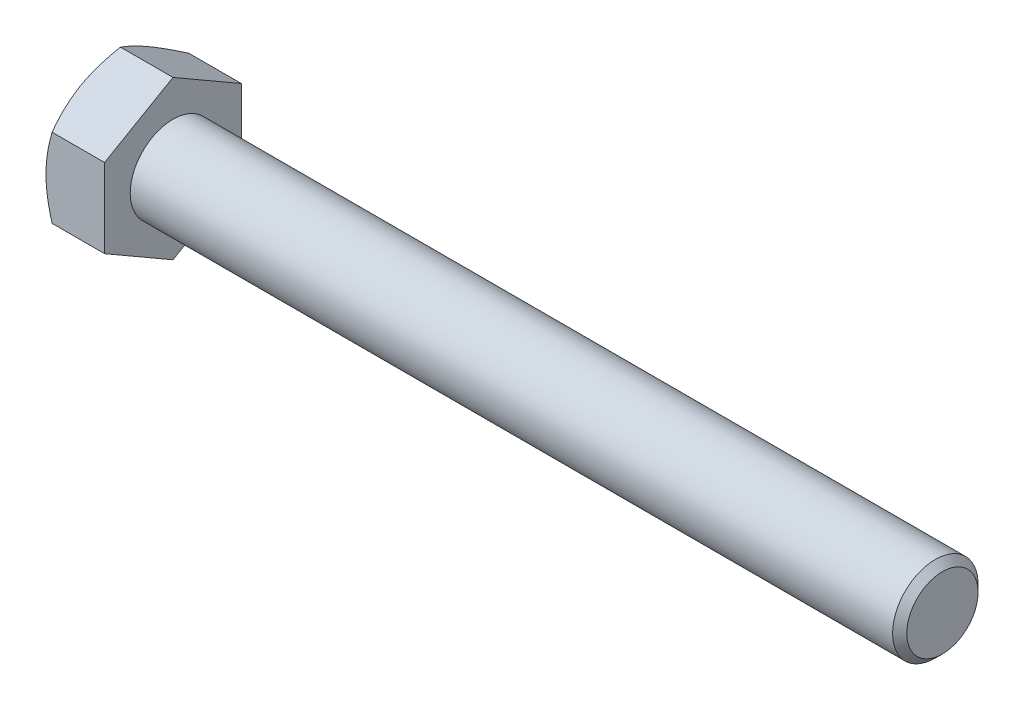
ISO-10303-21;
HEADER;
FILE_DESCRIPTION(('STEP AP214'),'2;1');
FILE_NAME('part.step','',(''),(''),'','','');
FILE_SCHEMA(('AUTOMOTIVE_DESIGN { 1 0 10303 214 1 1 1 1 }'));
ENDSEC;
DATA;
#1=APPLICATION_CONTEXT('core data for automotive mechanical design processes');
#2=APPLICATION_PROTOCOL_DEFINITION('international standard','automotive_design',2000,#1);
#3=PRODUCT_CONTEXT('',#1,'mechanical');
#4=PRODUCT('Part','Part','',(#3));
#5=PRODUCT_RELATED_PRODUCT_CATEGORY('part','',(#4));
#6=PRODUCT_DEFINITION_FORMATION('','',#4);
#7=PRODUCT_DEFINITION_CONTEXT('part definition',#1,'design');
#8=PRODUCT_DEFINITION('design','',#6,#7);
#9=PRODUCT_DEFINITION_SHAPE('','',#8);
#10=(LENGTH_UNIT() NAMED_UNIT(*) SI_UNIT(.MILLI.,.METRE.));
#11=(NAMED_UNIT(*) PLANE_ANGLE_UNIT() SI_UNIT($,.RADIAN.));
#12=(NAMED_UNIT(*) SI_UNIT($,.STERADIAN.) SOLID_ANGLE_UNIT());
#13=UNCERTAINTY_MEASURE_WITH_UNIT(LENGTH_MEASURE(1.E-05),#10,'distance_accuracy_value','');
#14=(GEOMETRIC_REPRESENTATION_CONTEXT(3) GLOBAL_UNCERTAINTY_ASSIGNED_CONTEXT((#13)) GLOBAL_UNIT_ASSIGNED_CONTEXT((#10,
#11,#12)) REPRESENTATION_CONTEXT('',''));
#15=CARTESIAN_POINT('',(0.,0.,0.));
#16=DIRECTION('',(0.,0.,1.));
#17=DIRECTION('',(1.,0.,0.));
#18=AXIS2_PLACEMENT_3D('',#15,#16,#17);
#19=CARTESIAN_POINT('',(6.85,4.618802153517,-8.));
#20=DIRECTION('',(0.,-0.866025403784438,0.500000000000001));
#21=DIRECTION('',(0.,-0.500000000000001,-0.866025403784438));
#22=AXIS2_PLACEMENT_3D('',#19,#20,#21);
#23=PLANE('',#22);
#24=CARTESIAN_POINT('',(0.714597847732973,9.23771977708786,0.0002));
#25=CARTESIAN_POINT('',(0.655990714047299,9.13619343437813,-0.175648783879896));
#26=CARTESIAN_POINT('',(0.600043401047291,9.03428856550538,-0.352153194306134));
#27=CARTESIAN_POINT('',(0.494201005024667,8.82965122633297,-0.706595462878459));
#28=CARTESIAN_POINT('',(0.444308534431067,8.72691841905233,-0.884533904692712));
#29=CARTESIAN_POINT('',(0.304692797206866,8.41707512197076,-1.42119823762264));
#30=CARTESIAN_POINT('',(0.22528117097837,8.20874154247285,-1.78204258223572));
#31=CARTESIAN_POINT('',(0.13216164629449,7.89697436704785,-2.32203917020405));
#32=CARTESIAN_POINT('',(0.105634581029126,7.79447216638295,-2.49957818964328));
#33=CARTESIAN_POINT('',(0.0611531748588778,7.58900421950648,-2.8554591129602));
#34=CARTESIAN_POINT('',(0.0431980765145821,7.4860385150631,-3.03380094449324));
#35=CARTESIAN_POINT('',(0.0163156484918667,7.27992981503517,-3.39079168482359));
#36=CARTESIAN_POINT('',(0.00737807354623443,7.17678715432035,-3.5694400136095));
#37=CARTESIAN_POINT('',(-0.00127769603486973,6.97040655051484,-3.92690170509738));
#38=CARTESIAN_POINT('',(-0.000996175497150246,6.86716861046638,-4.10571506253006));
#39=CARTESIAN_POINT('',(0.0081450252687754,6.67416139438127,-4.4400133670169));
#40=CARTESIAN_POINT('',(0.0158896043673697,6.58437849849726,-4.59552190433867));
#41=CARTESIAN_POINT('',(0.0382011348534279,6.40502298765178,-4.90617476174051));
#42=CARTESIAN_POINT('',(0.0527685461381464,6.31545038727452,-5.06131905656));
#43=CARTESIAN_POINT('',(0.106360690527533,6.04707935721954,-5.52615131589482));
#44=CARTESIAN_POINT('',(0.155268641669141,5.86875596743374,-5.83501648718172));
#45=CARTESIAN_POINT('',(0.277539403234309,5.51021755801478,-6.4560232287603));
#46=CARTESIAN_POINT('',(0.351420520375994,5.3300482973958,-6.76808554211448));
#47=CARTESIAN_POINT('',(0.519100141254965,4.97239658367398,-7.38755648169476));
#48=CARTESIAN_POINT('',(0.612859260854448,4.79490955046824,-7.69497304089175));
#49=CARTESIAN_POINT('',(0.714597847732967,4.61868668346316,-8.0002));
#50=B_SPLINE_CURVE_WITH_KNOTS('',3,(#24,#25,#26,#27,#28,#29,#30,#31,#32,#33,#34,#35,#36,#37,#38,
#39,#40,#41,#42,#43,#44,#45,#46,#47,#48,#49),.UNSPECIFIED.,.F.,.F.,(4,2,2,2,2,2,2,2,2,2,2,2,4),
(0.,0.63397354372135,1.26821965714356,2.53934712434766,3.15934343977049,3.77928496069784,
4.39852133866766,5.01773858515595,5.55680239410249,6.09590254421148,7.17487077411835,
8.27776850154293,9.37850115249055),.UNSPECIFIED.);
#51=CARTESIAN_POINT('',(0.714531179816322,9.23760430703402,0.));
#52=VERTEX_POINT('',#51);
#53=CARTESIAN_POINT('',(0.,6.92820323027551,-4.00000000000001));
#54=VERTEX_POINT('',#53);
#55=EDGE_CURVE('E52',#52,#54,#50,.T.);
#56=ORIENTED_EDGE('',*,*,#55,.F.);
#57=DIRECTION('',(-1.,0.,0.));
#58=VECTOR('',#57,1.);
#59=CARTESIAN_POINT('',(6.85,9.23760430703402,0.));
#60=LINE('',#59,#58);
#61=CARTESIAN_POINT('',(6.85,9.23760430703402,0.));
#62=VERTEX_POINT('',#61);
#63=EDGE_CURVE('E148',#62,#52,#60,.T.);
#64=ORIENTED_EDGE('',*,*,#63,.F.);
#65=DIRECTION('',(0.,0.500000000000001,0.866025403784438));
#66=VECTOR('',#65,1.);
#67=CARTESIAN_POINT('',(6.85,4.618802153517,-8.));
#68=LINE('',#67,#66);
#69=CARTESIAN_POINT('',(6.85,4.618802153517,-8.));
#70=VERTEX_POINT('',#69);
#71=EDGE_CURVE('E233',#70,#62,#68,.T.);
#72=ORIENTED_EDGE('',*,*,#71,.F.);
#73=DIRECTION('',(-1.,0.,0.));
#74=VECTOR('',#73,1.);
#75=CARTESIAN_POINT('',(6.85,4.618802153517,-8.));
#76=LINE('',#75,#74);
#77=CARTESIAN_POINT('',(0.714531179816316,4.618802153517,-8.));
#78=VERTEX_POINT('',#77);
#79=EDGE_CURVE('E136',#70,#78,#76,.T.);
#80=ORIENTED_EDGE('',*,*,#79,.T.);
#81=EDGE_CURVE('E130',#54,#78,#50,.T.);
#82=ORIENTED_EDGE('',*,*,#81,.F.);
#83=EDGE_LOOP('',(#56,#64,#72,#80,#82));
#84=FACE_BOUND('',#83,.T.);
#85=ADVANCED_FACE('F36',(#84),#23,.F.);
#86=CARTESIAN_POINT('',(6.85,9.23760430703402,0.));
#87=DIRECTION('',(0.,-0.866025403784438,-0.500000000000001));
#88=DIRECTION('',(0.,0.500000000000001,-0.866025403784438));
#89=AXIS2_PLACEMENT_3D('',#86,#87,#88);
#90=PLANE('',#89);
#91=CARTESIAN_POINT('',(0.714597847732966,4.61868668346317,8.0002));
#92=CARTESIAN_POINT('',(0.655990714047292,4.72021302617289,7.8243512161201));
#93=CARTESIAN_POINT('',(0.600043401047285,4.82211789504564,7.64784680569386));
#94=CARTESIAN_POINT('',(0.494201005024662,5.02675523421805,7.29340453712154));
#95=CARTESIAN_POINT('',(0.444308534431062,5.12948804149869,7.11546609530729));
#96=CARTESIAN_POINT('',(0.304692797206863,5.43933133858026,6.57880176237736));
#97=CARTESIAN_POINT('',(0.225281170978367,5.64766491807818,6.21795741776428));
#98=CARTESIAN_POINT('',(0.132161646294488,5.95943209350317,5.67796082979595));
#99=CARTESIAN_POINT('',(0.105634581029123,6.06193429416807,5.50042181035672));
#100=CARTESIAN_POINT('',(0.0611531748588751,6.26740224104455,5.1445408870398));
#101=CARTESIAN_POINT('',(0.04319807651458,6.37036794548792,4.96619905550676));
#102=CARTESIAN_POINT('',(0.0163156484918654,6.57647664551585,4.60920831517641));
#103=CARTESIAN_POINT('',(0.00737807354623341,6.67961930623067,4.4305599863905));
#104=CARTESIAN_POINT('',(-0.00127769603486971,6.88599991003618,4.07309829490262));
#105=CARTESIAN_POINT('',(-0.000996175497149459,6.98923785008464,3.89428493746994));
#106=CARTESIAN_POINT('',(0.00814502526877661,7.18224506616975,3.5599866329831));
#107=CARTESIAN_POINT('',(0.0158896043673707,7.27202796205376,3.40447809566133));
#108=CARTESIAN_POINT('',(0.0382011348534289,7.45138347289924,3.09382523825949));
#109=CARTESIAN_POINT('',(0.0527685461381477,7.54095607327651,2.93868094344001));
#110=CARTESIAN_POINT('',(0.106360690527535,7.80932710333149,2.47384868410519));
#111=CARTESIAN_POINT('',(0.155268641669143,7.98765049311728,2.16498351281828));
#112=CARTESIAN_POINT('',(0.277539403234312,8.34618890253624,1.5439767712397));
#113=CARTESIAN_POINT('',(0.351420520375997,8.52635816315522,1.23191445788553));
#114=CARTESIAN_POINT('',(0.519100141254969,8.88400987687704,0.612443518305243));
#115=CARTESIAN_POINT('',(0.612859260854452,9.06149691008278,0.30502695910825));
#116=CARTESIAN_POINT('',(0.714597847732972,9.23771977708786,-0.00019999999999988));
#117=B_SPLINE_CURVE_WITH_KNOTS('',3,(#91,#92,#93,#94,#95,#96,#97,#98,#99,#100,#101,#102,#103,
#104,#105,#106,#107,#108,#109,#110,#111,#112,#113,#114,#115,#116),.UNSPECIFIED.,.F.,.F.,(4,2,2,
2,2,2,2,2,2,2,2,2,4),(0.,0.633973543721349,1.26821965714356,2.53934712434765,3.15934343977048,
3.77928496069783,4.39852133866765,5.01773858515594,5.55680239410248,6.09590254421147,
7.17487077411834,8.27776850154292,9.37850115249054),.UNSPECIFIED.);
#118=CARTESIAN_POINT('',(0.714531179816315,4.61880215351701,8.));
#119=VERTEX_POINT('',#118);
#120=CARTESIAN_POINT('',(0.,6.92820323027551,4.00000000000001));
#121=VERTEX_POINT('',#120);
#122=EDGE_CURVE('E59',#119,#121,#117,.T.);
#123=ORIENTED_EDGE('',*,*,#122,.F.);
#124=DIRECTION('',(-1.,0.,0.));
#125=VECTOR('',#124,1.);
#126=CARTESIAN_POINT('',(6.85,4.61880215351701,8.));
#127=LINE('',#126,#125);
#128=CARTESIAN_POINT('',(6.85,4.61880215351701,8.));
#129=VERTEX_POINT('',#128);
#130=EDGE_CURVE('E146',#129,#119,#127,.T.);
#131=ORIENTED_EDGE('',*,*,#130,.F.);
#132=DIRECTION('',(0.,-0.500000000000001,0.866025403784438));
#133=VECTOR('',#132,1.);
#134=CARTESIAN_POINT('',(6.85,9.23760430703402,0.));
#135=LINE('',#134,#133);
#136=EDGE_CURVE('E231',#62,#129,#135,.T.);
#137=ORIENTED_EDGE('',*,*,#136,.F.);
#138=ORIENTED_EDGE('',*,*,#63,.T.);
#139=EDGE_CURVE('E163',#121,#52,#117,.T.);
#140=ORIENTED_EDGE('',*,*,#139,.F.);
#141=EDGE_LOOP('',(#123,#131,#137,#138,#140));
#142=FACE_BOUND('',#141,.T.);
#143=ADVANCED_FACE('F169',(#142),#90,.F.);
#144=CARTESIAN_POINT('',(6.85,4.61880215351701,8.));
#145=DIRECTION('',(0.,0.,-1.));
#146=DIRECTION('',(0.,1.,0.));
#147=AXIS2_PLACEMENT_3D('',#144,#145,#146);
#148=PLANE('',#147);
#149=CARTESIAN_POINT('',(4.02490591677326,-12.6546855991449,8.));
#150=CARTESIAN_POINT('',(3.85338488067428,-12.3031246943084,8.));
#151=CARTESIAN_POINT('',(3.68343820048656,-11.9507829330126,8.));
#152=CARTESIAN_POINT('',(3.3475742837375,-11.2441233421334,8.));
#153=CARTESIAN_POINT('',(3.18165763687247,-10.8898052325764,8.));
#154=CARTESIAN_POINT('',(2.85395194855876,-10.1770689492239,8.));
#155=CARTESIAN_POINT('',(2.69218825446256,-9.81863908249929,8.));
#156=CARTESIAN_POINT('',(2.37495727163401,-9.09901413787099,8.));
#157=CARTESIAN_POINT('',(2.21948970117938,-8.73781918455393,8.));
#158=CARTESIAN_POINT('',(1.91124909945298,-7.9995005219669,8.));
#159=CARTESIAN_POINT('',(1.75875676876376,-7.6222589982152,8.));
#160=CARTESIAN_POINT('',(1.46472411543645,-6.86345577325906,8.));
#161=CARTESIAN_POINT('',(1.323184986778,-6.48189360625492,8.));
#162=CARTESIAN_POINT('',(1.05459432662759,-5.71447512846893,8.));
#163=CARTESIAN_POINT('',(0.927515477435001,-5.32862847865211,8.));
#164=CARTESIAN_POINT('',(0.69175721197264,-4.55141880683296,8.));
#165=CARTESIAN_POINT('',(0.583072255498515,-4.16005748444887,8.));
#166=CARTESIAN_POINT('',(0.389750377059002,-3.37376378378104,8.));
#167=CARTESIAN_POINT('',(0.304973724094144,-2.97886668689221,8.));
#168=CARTESIAN_POINT('',(0.199275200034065,-2.38273452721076,8.));
#169=CARTESIAN_POINT('',(0.167618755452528,-2.18337977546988,8.));
#170=CARTESIAN_POINT('',(0.112075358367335,-1.78359737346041,8.));
#171=CARTESIAN_POINT('',(0.0881876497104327,-1.58316982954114,8.));
#172=CARTESIAN_POINT('',(0.0489706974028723,-1.184235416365,8.));
#173=CARTESIAN_POINT('',(0.0335291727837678,-0.985739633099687,8.));
#174=CARTESIAN_POINT('',(0.0110629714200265,-0.58827208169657,8.));
#175=CARTESIAN_POINT('',(0.00403814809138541,-0.38930032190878,8.));
#176=CARTESIAN_POINT('',(-0.00142584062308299,0.00876221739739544,8.));
#177=CARTESIAN_POINT('',(0.000134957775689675,0.207852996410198,8.));
#178=CARTESIAN_POINT('',(0.0118014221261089,0.605786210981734,8.));
#179=CARTESIAN_POINT('',(0.0219074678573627,0.804628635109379,8.));
#180=CARTESIAN_POINT('',(0.0557165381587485,1.27520492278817,8.));
#181=CARTESIAN_POINT('',(0.0830672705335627,1.5466829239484,8.));
#182=CARTESIAN_POINT('',(0.152259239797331,2.08777093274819,8.));
#183=CARTESIAN_POINT('',(0.194102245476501,2.35738070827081,8.));
#184=CARTESIAN_POINT('',(0.33916319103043,3.1630177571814,7.99999999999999));
#185=CARTESIAN_POINT('',(0.461891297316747,3.69558689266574,8.));
#186=CARTESIAN_POINT('',(0.676586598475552,4.49226054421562,8.));
#187=CARTESIAN_POINT('',(0.754301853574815,4.76044513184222,8.));
#188=CARTESIAN_POINT('',(0.918275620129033,5.29421545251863,8.));
#189=CARTESIAN_POINT('',(1.00453419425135,5.55980116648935,8.));
#190=CARTESIAN_POINT('',(1.1841720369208,6.08844838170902,8.));
#191=CARTESIAN_POINT('',(1.27754932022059,6.35151056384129,8.));
#192=CARTESIAN_POINT('',(1.47027925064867,6.8754242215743,8.));
#193=CARTESIAN_POINT('',(1.56963178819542,7.1362757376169,7.99999999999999));
#194=CARTESIAN_POINT('',(1.83061788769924,7.80218876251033,7.99999999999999));
#195=CARTESIAN_POINT('',(1.99585031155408,8.20583801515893,7.99999999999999));
#196=CARTESIAN_POINT('',(2.33560644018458,9.00922091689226,7.99999999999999));
#197=CARTESIAN_POINT('',(2.51013099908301,9.40895420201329,7.99999999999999));
#198=CARTESIAN_POINT('',(2.86641485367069,10.2053302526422,7.99999999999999));
#199=CARTESIAN_POINT('',(3.04817649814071,10.6019719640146,7.99999999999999));
#200=CARTESIAN_POINT('',(3.41731475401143,11.3926098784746,7.99999999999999));
#201=CARTESIAN_POINT('',(3.60469118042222,11.7866061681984,7.99999999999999));
#202=CARTESIAN_POINT('',(3.98417977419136,12.5730081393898,7.99999999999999));
#203=CARTESIAN_POINT('',(4.17629838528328,12.9654107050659,7.99999999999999));
#204=CARTESIAN_POINT('',(4.56413461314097,13.7484335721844,7.99999999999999));
#205=CARTESIAN_POINT('',(4.75985225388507,14.1390538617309,7.99999999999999));
#206=CARTESIAN_POINT('',(5.15417791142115,14.9187387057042,7.99999999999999));
#207=CARTESIAN_POINT('',(5.35278537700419,15.3078035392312,7.99999999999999));
#208=CARTESIAN_POINT('',(5.75241278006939,16.0846929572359,7.99999999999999));
#209=CARTESIAN_POINT('',(5.95343272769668,16.4725175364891,7.99999999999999));
#210=CARTESIAN_POINT('',(6.52023158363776,17.559169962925,7.99999999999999));
#211=CARTESIAN_POINT('',(6.88826669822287,18.2568208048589,7.99999999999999));
#212=CARTESIAN_POINT('',(7.62911646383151,19.6496204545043,7.99999999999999));
#213=CARTESIAN_POINT('',(8.00193136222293,20.3447691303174,7.99999999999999));
#214=CARTESIAN_POINT('',(8.74998840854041,21.7309493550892,7.99999999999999));
#215=CARTESIAN_POINT('',(9.12521930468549,22.4219869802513,7.99999999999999));
#216=CARTESIAN_POINT('',(9.69012626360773,23.4573861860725,7.99999999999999));
#217=CARTESIAN_POINT('',(9.87876537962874,23.8023143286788,7.99999999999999));
#218=CARTESIAN_POINT('',(10.2566598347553,24.491832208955,7.99999999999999));
#219=CARTESIAN_POINT('',(10.4459151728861,24.8364219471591,7.99999999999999));
#220=CARTESIAN_POINT('',(10.6354414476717,25.1808626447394,7.99999999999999));
#221=B_SPLINE_CURVE_WITH_KNOTS('',3,(#149,#150,#151,#152,#153,#154,#155,#156,#157,#158,#159,
#160,#161,#162,#163,#164,#165,#166,#167,#168,#169,#170,#171,#172,#173,#174,#175,#176,#177,#178,
#179,#180,#181,#182,#183,#184,#185,#186,#187,#188,#189,#190,#191,#192,#193,#194,#195,#196,#197,
#198,#199,#200,#201,#202,#203,#204,#205,#206,#207,#208,#209,#210,#211,#212,#213,#214,#215,#216,
#217,#218,#219,#220),.UNSPECIFIED.,.F.,.F.,(4,2,2,2,2,2,2,2,2,2,2,2,2,2,2,2,2,2,2,2,2,2,2,2,2,2,
2,2,2,2,2,2,2,2,2,4),(0.,1.17352534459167,2.34722138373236,3.52689945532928,4.70652468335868,
5.92708318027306,7.14777454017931,8.36612013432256,9.58409810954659,10.7948027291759,
11.40023293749,12.0056041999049,12.6027191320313,13.1998236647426,13.7969256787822,
14.3940542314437,15.2121538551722,16.0303533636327,17.6675489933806,18.5051258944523,
19.3427089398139,20.180059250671,21.0173942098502,22.3257038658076,23.6341339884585,
24.9429922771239,26.2518074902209,27.5625113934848,28.8732240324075,30.1836898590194,
31.4941611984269,33.8604586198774,36.2268790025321,38.5858914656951,39.7653151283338,
40.9447369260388),.UNSPECIFIED.);
#222=CARTESIAN_POINT('',(0.714531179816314,-4.618802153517,8.));
#223=VERTEX_POINT('',#222);
#224=CARTESIAN_POINT('',(0.,0.,8.));
#225=VERTEX_POINT('',#224);
#226=EDGE_CURVE('E243',#223,#225,#221,.T.);
#227=ORIENTED_EDGE('',*,*,#226,.F.);
#228=DIRECTION('',(-1.,0.,0.));
#229=VECTOR('',#228,1.);
#230=CARTESIAN_POINT('',(6.85,-4.61880215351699,8.));
#231=LINE('',#230,#229);
#232=CARTESIAN_POINT('',(6.85,-4.61880215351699,8.));
#233=VERTEX_POINT('',#232);
#234=EDGE_CURVE('E138',#233,#223,#231,.T.);
#235=ORIENTED_EDGE('',*,*,#234,.F.);
#236=DIRECTION('',(0.,-1.,0.));
#237=VECTOR('',#236,1.);
#238=CARTESIAN_POINT('',(6.85,4.61880215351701,8.));
#239=LINE('',#238,#237);
#240=EDGE_CURVE('E227',#129,#233,#239,.T.);
#241=ORIENTED_EDGE('',*,*,#240,.F.);
#242=ORIENTED_EDGE('',*,*,#130,.T.);
#243=EDGE_CURVE('E185',#225,#119,#221,.T.);
#244=ORIENTED_EDGE('',*,*,#243,.F.);
#245=EDGE_LOOP('',(#227,#235,#241,#242,#244));
#246=FACE_BOUND('',#245,.T.);
#247=ADVANCED_FACE('F249',(#246),#148,.F.);
#248=CARTESIAN_POINT('',(6.85,-9.23760430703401,0.));
#249=DIRECTION('',(0.,0.866025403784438,-0.500000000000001));
#250=DIRECTION('',(0.,0.500000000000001,0.866025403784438));
#251=AXIS2_PLACEMENT_3D('',#248,#249,#250);
#252=PLANE('',#251);
#253=CARTESIAN_POINT('',(0.714597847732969,-9.23771977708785,-0.000199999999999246));
#254=CARTESIAN_POINT('',(0.655990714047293,-9.13619343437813,0.175648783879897));
#255=CARTESIAN_POINT('',(0.600043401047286,-9.03428856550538,0.352153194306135));
#256=CARTESIAN_POINT('',(0.494201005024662,-8.82965122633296,0.70659546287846));
#257=CARTESIAN_POINT('',(0.444308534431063,-8.72691841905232,0.884533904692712));
#258=CARTESIAN_POINT('',(0.304692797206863,-8.41707512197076,1.42119823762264));
#259=CARTESIAN_POINT('',(0.225281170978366,-8.20874154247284,1.78204258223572));
#260=CARTESIAN_POINT('',(0.132161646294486,-7.89697436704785,2.32203917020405));
#261=CARTESIAN_POINT('',(0.105634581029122,-7.79447216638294,2.49957818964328));
#262=CARTESIAN_POINT('',(0.0611531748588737,-7.58900421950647,2.8554591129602));
#263=CARTESIAN_POINT('',(0.0431980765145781,-7.4860385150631,3.03380094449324));
#264=CARTESIAN_POINT('',(0.0163156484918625,-7.27992981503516,3.39079168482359));
#265=CARTESIAN_POINT('',(0.00737807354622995,-7.17678715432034,3.5694400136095));
#266=CARTESIAN_POINT('',(-0.00127769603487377,-6.97040655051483,3.92690170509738));
#267=CARTESIAN_POINT('',(-0.000996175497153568,-6.86716861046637,4.10571506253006));
#268=CARTESIAN_POINT('',(0.00814502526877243,-6.67416139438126,4.4400133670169));
#269=CARTESIAN_POINT('',(0.0158896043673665,-6.58437849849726,4.59552190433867));
#270=CARTESIAN_POINT('',(0.0382011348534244,-6.40502298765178,4.90617476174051));
#271=CARTESIAN_POINT('',(0.0527685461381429,-6.31545038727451,5.06131905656));
#272=CARTESIAN_POINT('',(0.10636069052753,-6.04707935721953,5.52615131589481));
#273=CARTESIAN_POINT('',(0.155268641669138,-5.86875596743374,5.83501648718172));
#274=CARTESIAN_POINT('',(0.277539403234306,-5.51021755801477,6.4560232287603));
#275=CARTESIAN_POINT('',(0.351420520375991,-5.3300482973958,6.76808554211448));
#276=CARTESIAN_POINT('',(0.519100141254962,-4.97239658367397,7.38755648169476));
#277=CARTESIAN_POINT('',(0.612859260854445,-4.79490955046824,7.69497304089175));
#278=CARTESIAN_POINT('',(0.714597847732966,-4.61868668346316,8.0002));
#279=B_SPLINE_CURVE_WITH_KNOTS('',3,(#253,#254,#255,#256,#257,#258,#259,#260,#261,#262,#263,
#264,#265,#266,#267,#268,#269,#270,#271,#272,#273,#274,#275,#276,#277,#278),.UNSPECIFIED.,.F.,
.F.,(4,2,2,2,2,2,2,2,2,2,2,2,4),(0.,0.633973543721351,1.26821965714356,2.53934712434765,
3.15934343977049,3.77928496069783,4.39852133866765,5.01773858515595,5.55680239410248,
6.09590254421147,7.17487077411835,8.27776850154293,9.37850115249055),.UNSPECIFIED.);
#280=CARTESIAN_POINT('',(0.714531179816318,-9.23760430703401,0.));
#281=VERTEX_POINT('',#280);
#282=CARTESIAN_POINT('',(0.,-6.9282032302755,4.00000000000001));
#283=VERTEX_POINT('',#282);
#284=EDGE_CURVE('E171',#281,#283,#279,.T.);
#285=ORIENTED_EDGE('',*,*,#284,.F.);
#286=DIRECTION('',(-1.,0.,0.));
#287=VECTOR('',#286,1.);
#288=CARTESIAN_POINT('',(6.85,-9.23760430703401,0.));
#289=LINE('',#288,#287);
#290=CARTESIAN_POINT('',(6.85,-9.23760430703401,0.));
#291=VERTEX_POINT('',#290);
#292=EDGE_CURVE('E135',#291,#281,#289,.T.);
#293=ORIENTED_EDGE('',*,*,#292,.F.);
#294=DIRECTION('',(0.,-0.500000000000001,-0.866025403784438));
#295=VECTOR('',#294,1.);
#296=CARTESIAN_POINT('',(6.85,-9.23760430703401,0.));
#297=LINE('',#296,#295);
#298=EDGE_CURVE('E225',#233,#291,#297,.T.);
#299=ORIENTED_EDGE('',*,*,#298,.F.);
#300=ORIENTED_EDGE('',*,*,#234,.T.);
#301=EDGE_CURVE('E173',#283,#223,#279,.T.);
#302=ORIENTED_EDGE('',*,*,#301,.F.);
#303=EDGE_LOOP('',(#285,#293,#299,#300,#302));
#304=FACE_BOUND('',#303,.T.);
#305=ADVANCED_FACE('F221',(#304),#252,.F.);
#306=CARTESIAN_POINT('',(6.85,-4.61880215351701,-8.));
#307=DIRECTION('',(0.,0.866025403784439,0.5));
#308=DIRECTION('',(0.,-0.5,0.866025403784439));
#309=AXIS2_PLACEMENT_3D('',#306,#307,#308);
#310=PLANE('',#309);
#311=CARTESIAN_POINT('',(0.71459784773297,-4.61868668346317,-8.0002));
#312=CARTESIAN_POINT('',(0.655990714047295,-4.7202130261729,-7.82435121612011));
#313=CARTESIAN_POINT('',(0.600043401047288,-4.82211789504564,-7.64784680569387));
#314=CARTESIAN_POINT('',(0.494201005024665,-5.02675523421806,-7.29340453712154));
#315=CARTESIAN_POINT('',(0.444308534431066,-5.1294880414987,-7.11546609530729));
#316=CARTESIAN_POINT('',(0.304692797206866,-5.43933133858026,-6.57880176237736));
#317=CARTESIAN_POINT('',(0.225281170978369,-5.64766491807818,-6.21795741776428));
#318=CARTESIAN_POINT('',(0.132161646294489,-5.95943209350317,-5.67796082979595));
#319=CARTESIAN_POINT('',(0.105634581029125,-6.06193429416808,-5.50042181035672));
#320=CARTESIAN_POINT('',(0.0611531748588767,-6.26740224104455,-5.1445408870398));
#321=CARTESIAN_POINT('',(0.0431980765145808,-6.37036794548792,-4.96619905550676));
#322=CARTESIAN_POINT('',(0.0163156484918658,-6.57647664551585,-4.60920831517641));
#323=CARTESIAN_POINT('',(0.00737807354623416,-6.67961930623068,-4.4305599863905));
#324=CARTESIAN_POINT('',(-0.00127769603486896,-6.88599991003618,-4.07309829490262));
#325=CARTESIAN_POINT('',(-0.000996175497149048,-6.98923785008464,-3.89428493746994));
#326=CARTESIAN_POINT('',(0.00814502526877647,-7.18224506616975,-3.5599866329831));
#327=CARTESIAN_POINT('',(0.0158896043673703,-7.27202796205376,-3.40447809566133));
#328=CARTESIAN_POINT('',(0.0382011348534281,-7.45138347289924,-3.09382523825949));
#329=CARTESIAN_POINT('',(0.0527685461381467,-7.5409560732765,-2.93868094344));
#330=CARTESIAN_POINT('',(0.106360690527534,-7.80932710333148,-2.47384868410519));
#331=CARTESIAN_POINT('',(0.155268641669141,-7.98765049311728,-2.16498351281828));
#332=CARTESIAN_POINT('',(0.277539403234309,-8.34618890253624,-1.5439767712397));
#333=CARTESIAN_POINT('',(0.351420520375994,-8.52635816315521,-1.23191445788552));
#334=CARTESIAN_POINT('',(0.519100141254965,-8.88400987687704,-0.612443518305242));
#335=CARTESIAN_POINT('',(0.612859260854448,-9.06149691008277,-0.30502695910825));
#336=CARTESIAN_POINT('',(0.714597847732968,-9.23771977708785,0.00020000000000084));
#337=B_SPLINE_CURVE_WITH_KNOTS('',3,(#311,#312,#313,#314,#315,#316,#317,#318,#319,#320,#321,
#322,#323,#324,#325,#326,#327,#328,#329,#330,#331,#332,#333,#334,#335,#336),.UNSPECIFIED.,.F.,
.F.,(4,2,2,2,2,2,2,2,2,2,2,2,4),(0.,0.633973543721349,1.26821965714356,2.53934712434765,
3.15934343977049,3.77928496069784,4.39852133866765,5.01773858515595,5.55680239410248,
6.09590254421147,7.17487077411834,8.27776850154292,9.37850115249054),.UNSPECIFIED.);
#338=CARTESIAN_POINT('',(0.714531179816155,-4.61880215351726,-8.));
#339=VERTEX_POINT('',#338);
#340=CARTESIAN_POINT('',(0.,-6.92820323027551,-4.));
#341=VERTEX_POINT('',#340);
#342=EDGE_CURVE('E112',#339,#341,#337,.T.);
#343=ORIENTED_EDGE('',*,*,#342,.F.);
#344=DIRECTION('',(-1.,0.,0.));
#345=VECTOR('',#344,1.);
#346=CARTESIAN_POINT('',(6.85,-4.61880215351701,-8.));
#347=LINE('',#346,#345);
#348=CARTESIAN_POINT('',(6.85,-4.61880215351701,-8.));
#349=VERTEX_POINT('',#348);
#350=EDGE_CURVE('E126',#349,#339,#347,.T.);
#351=ORIENTED_EDGE('',*,*,#350,.F.);
#352=DIRECTION('',(0.,0.5,-0.866025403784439));
#353=VECTOR('',#352,1.);
#354=CARTESIAN_POINT('',(6.85,-4.61880215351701,-8.));
#355=LINE('',#354,#353);
#356=EDGE_CURVE('E223',#291,#349,#355,.T.);
#357=ORIENTED_EDGE('',*,*,#356,.F.);
#358=ORIENTED_EDGE('',*,*,#292,.T.);
#359=EDGE_CURVE('E129',#341,#281,#337,.T.);
#360=ORIENTED_EDGE('',*,*,#359,.F.);
#361=EDGE_LOOP('',(#343,#351,#357,#358,#360));
#362=FACE_BOUND('',#361,.T.);
#363=ADVANCED_FACE('F124',(#362),#310,.F.);
#364=CARTESIAN_POINT('',(6.85,4.618802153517,-8.));
#365=DIRECTION('',(0.,0.,1.));
#366=DIRECTION('',(0.,-1.,0.));
#367=AXIS2_PLACEMENT_3D('',#364,#365,#366);
#368=PLANE('',#367);
#369=CARTESIAN_POINT('',(4.02490591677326,-12.6546855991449,-8.));
#370=CARTESIAN_POINT('',(3.85338488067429,-12.3031246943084,-8.));
#371=CARTESIAN_POINT('',(3.68343820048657,-11.9507829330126,-8.));
#372=CARTESIAN_POINT('',(3.34757428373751,-11.2441233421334,-8.));
#373=CARTESIAN_POINT('',(3.18165763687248,-10.8898052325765,-8.));
#374=CARTESIAN_POINT('',(2.85395194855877,-10.177068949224,-8.));
#375=CARTESIAN_POINT('',(2.69218825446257,-9.8186390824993,-8.));
#376=CARTESIAN_POINT('',(2.37495727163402,-9.099014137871,-8.));
#377=CARTESIAN_POINT('',(2.21948970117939,-8.73781918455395,-8.));
#378=CARTESIAN_POINT('',(1.91124909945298,-7.99950052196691,-8.));
#379=CARTESIAN_POINT('',(1.75875676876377,-7.62225899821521,-8.));
#380=CARTESIAN_POINT('',(1.46472411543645,-6.86345577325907,-8.));
#381=CARTESIAN_POINT('',(1.323184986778,-6.48189360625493,-8.));
#382=CARTESIAN_POINT('',(1.05459432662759,-5.71447512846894,-8.));
#383=CARTESIAN_POINT('',(0.927515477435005,-5.32862847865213,-8.));
#384=CARTESIAN_POINT('',(0.691757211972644,-4.55141880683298,-8.));
#385=CARTESIAN_POINT('',(0.58307225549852,-4.16005748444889,-8.));
#386=CARTESIAN_POINT('',(0.389750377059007,-3.37376378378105,-8.));
#387=CARTESIAN_POINT('',(0.304973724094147,-2.97886668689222,-8.));
#388=CARTESIAN_POINT('',(0.199275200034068,-2.38273452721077,-8.));
#389=CARTESIAN_POINT('',(0.167618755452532,-2.18337977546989,-8.));
#390=CARTESIAN_POINT('',(0.112075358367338,-1.78359737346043,-8.));
#391=CARTESIAN_POINT('',(0.0881876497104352,-1.58316982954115,-8.));
#392=CARTESIAN_POINT('',(0.0489706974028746,-1.18423541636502,-8.));
#393=CARTESIAN_POINT('',(0.0335291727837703,-0.9857396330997,-8.));
#394=CARTESIAN_POINT('',(0.0110629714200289,-0.588272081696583,-8.));
#395=CARTESIAN_POINT('',(0.00403814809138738,-0.389300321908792,-8.));
#396=CARTESIAN_POINT('',(-0.001425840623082,0.00876221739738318,-8.));
#397=CARTESIAN_POINT('',(0.000134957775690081,0.207852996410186,-8.));
#398=CARTESIAN_POINT('',(0.0118014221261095,0.605786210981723,-8.));
#399=CARTESIAN_POINT('',(0.0219074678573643,0.804628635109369,-8.));
#400=CARTESIAN_POINT('',(0.0557165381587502,1.27520492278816,-8.));
#401=CARTESIAN_POINT('',(0.0830672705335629,1.54668292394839,-8.));
#402=CARTESIAN_POINT('',(0.15225923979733,2.08777093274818,-8.));
#403=CARTESIAN_POINT('',(0.194102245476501,2.3573807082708,-8.));
#404=CARTESIAN_POINT('',(0.339163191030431,3.16301775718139,-8.));
#405=CARTESIAN_POINT('',(0.461891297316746,3.69558689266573,-8.));
#406=CARTESIAN_POINT('',(0.676586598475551,4.49226054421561,-8.));
#407=CARTESIAN_POINT('',(0.754301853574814,4.76044513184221,-8.));
#408=CARTESIAN_POINT('',(0.918275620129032,5.29421545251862,-8.));
#409=CARTESIAN_POINT('',(1.00453419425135,5.55980116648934,-8.));
#410=CARTESIAN_POINT('',(1.1841720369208,6.088448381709,-8.));
#411=CARTESIAN_POINT('',(1.27754932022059,6.35151056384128,-8.));
#412=CARTESIAN_POINT('',(1.47027925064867,6.87542422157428,-8.));
#413=CARTESIAN_POINT('',(1.56963178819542,7.13627573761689,-8.));
#414=CARTESIAN_POINT('',(1.83061788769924,7.80218876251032,-8.));
#415=CARTESIAN_POINT('',(1.99585031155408,8.20583801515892,-8.));
#416=CARTESIAN_POINT('',(2.33560644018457,9.00922091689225,-8.));
#417=CARTESIAN_POINT('',(2.51013099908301,9.40895420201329,-8.));
#418=CARTESIAN_POINT('',(2.86641485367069,10.2053302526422,-8.));
#419=CARTESIAN_POINT('',(3.04817649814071,10.6019719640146,-8.));
#420=CARTESIAN_POINT('',(3.41731475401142,11.3926098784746,-8.));
#421=CARTESIAN_POINT('',(3.60469118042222,11.7866061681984,-8.));
#422=CARTESIAN_POINT('',(3.98417977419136,12.5730081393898,-8.));
#423=CARTESIAN_POINT('',(4.17629838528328,12.9654107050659,-8.));
#424=CARTESIAN_POINT('',(4.56413461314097,13.7484335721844,-8.));
#425=CARTESIAN_POINT('',(4.75985225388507,14.1390538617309,-8.));
#426=CARTESIAN_POINT('',(5.15417791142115,14.9187387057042,-8.));
#427=CARTESIAN_POINT('',(5.3527853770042,15.3078035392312,-8.));
#428=CARTESIAN_POINT('',(5.75241278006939,16.0846929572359,-8.));
#429=CARTESIAN_POINT('',(5.95343272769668,16.4725175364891,-8.));
#430=CARTESIAN_POINT('',(6.52023158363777,17.559169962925,-8.));
#431=CARTESIAN_POINT('',(6.88826669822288,18.2568208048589,-8.));
#432=CARTESIAN_POINT('',(7.62911646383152,19.6496204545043,-8.));
#433=CARTESIAN_POINT('',(8.00193136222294,20.3447691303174,-8.));
#434=CARTESIAN_POINT('',(8.74998840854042,21.7309493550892,-8.));
#435=CARTESIAN_POINT('',(9.12521930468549,22.4219869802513,-8.));
#436=CARTESIAN_POINT('',(9.69012626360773,23.4573861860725,-8.));
#437=CARTESIAN_POINT('',(9.87876537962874,23.8023143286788,-8.));
#438=CARTESIAN_POINT('',(10.2566598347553,24.491832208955,-8.));
#439=CARTESIAN_POINT('',(10.4459151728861,24.8364219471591,-8.));
#440=CARTESIAN_POINT('',(10.6354414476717,25.1808626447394,-8.));
#441=B_SPLINE_CURVE_WITH_KNOTS('',3,(#369,#370,#371,#372,#373,#374,#375,#376,#377,#378,#379,
#380,#381,#382,#383,#384,#385,#386,#387,#388,#389,#390,#391,#392,#393,#394,#395,#396,#397,#398,
#399,#400,#401,#402,#403,#404,#405,#406,#407,#408,#409,#410,#411,#412,#413,#414,#415,#416,#417,
#418,#419,#420,#421,#422,#423,#424,#425,#426,#427,#428,#429,#430,#431,#432,#433,#434,#435,#436,
#437,#438,#439,#440),.UNSPECIFIED.,.F.,.F.,(4,2,2,2,2,2,2,2,2,2,2,2,2,2,2,2,2,2,2,2,2,2,2,2,2,2,
2,2,2,2,2,2,2,2,2,4),(0.,1.17352534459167,2.34722138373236,3.52689945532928,4.70652468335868,
5.92708318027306,7.14777454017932,8.36612013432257,9.58409810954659,10.7948027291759,
11.40023293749,12.0056041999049,12.6027191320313,13.1998236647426,13.7969256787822,
14.3940542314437,15.2121538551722,16.0303533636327,17.6675489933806,18.5051258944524,
19.3427089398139,20.180059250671,21.0173942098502,22.3257038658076,23.6341339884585,
24.9429922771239,26.2518074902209,27.5625113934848,28.8732240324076,30.1836898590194,
31.4941611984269,33.8604586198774,36.2268790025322,38.5858914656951,39.7653151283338,
40.9447369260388),.UNSPECIFIED.);
#442=CARTESIAN_POINT('',(0.,0.,-8.));
#443=VERTEX_POINT('',#442);
#444=EDGE_CURVE('E118',#78,#443,#441,.F.);
#445=ORIENTED_EDGE('',*,*,#444,.F.);
#446=ORIENTED_EDGE('',*,*,#79,.F.);
#447=DIRECTION('',(0.,1.,0.));
#448=VECTOR('',#447,1.);
#449=CARTESIAN_POINT('',(6.85,4.618802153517,-8.));
#450=LINE('',#449,#448);
#451=EDGE_CURVE('E134',#349,#70,#450,.T.);
#452=ORIENTED_EDGE('',*,*,#451,.F.);
#453=ORIENTED_EDGE('',*,*,#350,.T.);
#454=EDGE_CURVE('E109',#443,#339,#441,.F.);
#455=ORIENTED_EDGE('',*,*,#454,.F.);
#456=EDGE_LOOP('',(#445,#446,#452,#453,#455));
#457=FACE_BOUND('',#456,.T.);
#458=ADVANCED_FACE('F132',(#457),#368,.F.);
#459=CARTESIAN_POINT('',(6.85,9.23760430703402,0.));
#460=DIRECTION('',(1.,0.,0.));
#461=DIRECTION('',(0.,0.,-1.));
#462=AXIS2_PLACEMENT_3D('',#459,#460,#461);
#463=PLANE('',#462);
#464=ORIENTED_EDGE('',*,*,#71,.T.);
#465=ORIENTED_EDGE('',*,*,#136,.T.);
#466=ORIENTED_EDGE('',*,*,#240,.T.);
#467=ORIENTED_EDGE('',*,*,#298,.T.);
#468=ORIENTED_EDGE('',*,*,#356,.T.);
#469=ORIENTED_EDGE('',*,*,#451,.T.);
#470=EDGE_LOOP('',(#464,#465,#466,#467,#468,#469));
#471=FACE_BOUND('',#470,.T.);
#472=CARTESIAN_POINT('',(6.85,0.,0.));
#473=DIRECTION('',(1.,0.,0.));
#474=DIRECTION('',(0.,0.,-1.));
#475=AXIS2_PLACEMENT_3D('',#472,#473,#474);
#476=CIRCLE('',#475,5.);
#477=CARTESIAN_POINT('',(6.85,0.,-5.));
#478=VERTEX_POINT('',#477);
#479=EDGE_CURVE('E236',#478,#478,#476,.F.);
#480=ORIENTED_EDGE('',*,*,#479,.T.);
#481=EDGE_LOOP('',(#480));
#482=FACE_BOUND('',#481,.T.);
#483=ADVANCED_FACE('F251',(#471,#482),#463,.T.);
#484=CARTESIAN_POINT('',(0.,0.,0.));
#485=DIRECTION('',(-1.,0.,0.));
#486=DIRECTION('',(0.,0.,1.));
#487=AXIS2_PLACEMENT_3D('',#484,#485,#486);
#488=CYLINDRICAL_SURFACE('',#487,5.);
#489=ORIENTED_EDGE('',*,*,#479,.F.);
#490=EDGE_LOOP('',(#489));
#491=FACE_BOUND('',#490,.T.);
#492=CARTESIAN_POINT('',(96.022,0.,0.));
#493=DIRECTION('',(-1.,0.,0.));
#494=DIRECTION('',(0.,0.,1.));
#495=AXIS2_PLACEMENT_3D('',#492,#493,#494);
#496=CIRCLE('',#495,5.);
#497=CARTESIAN_POINT('',(96.022,0.,5.));
#498=VERTEX_POINT('',#497);
#499=EDGE_CURVE('E239',#498,#498,#496,.T.);
#500=ORIENTED_EDGE('',*,*,#499,.T.);
#501=EDGE_LOOP('',(#500));
#502=FACE_BOUND('',#501,.T.);
#503=ADVANCED_FACE('F282',(#491,#502),#488,.T.);
#504=CARTESIAN_POINT('',(96.85,0.,0.));
#505=DIRECTION('',(-1.,0.,0.));
#506=DIRECTION('',(0.,0.,1.));
#507=AXIS2_PLACEMENT_3D('',#504,#505,#506);
#508=CONICAL_SURFACE('',#507,4.172,0.785398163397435);
#509=ORIENTED_EDGE('',*,*,#499,.F.);
#510=EDGE_LOOP('',(#509));
#511=FACE_BOUND('',#510,.T.);
#512=CARTESIAN_POINT('',(96.85,0.,0.));
#513=DIRECTION('',(-1.,0.,0.));
#514=DIRECTION('',(0.,0.,1.));
#515=AXIS2_PLACEMENT_3D('',#512,#513,#514);
#516=CIRCLE('',#515,4.172);
#517=CARTESIAN_POINT('',(96.85,0.,4.172));
#518=VERTEX_POINT('',#517);
#519=EDGE_CURVE('E241',#518,#518,#516,.T.);
#520=ORIENTED_EDGE('',*,*,#519,.T.);
#521=EDGE_LOOP('',(#520));
#522=FACE_BOUND('',#521,.T.);
#523=ADVANCED_FACE('F285',(#511,#522),#508,.T.);
#524=CARTESIAN_POINT('',(96.85,0.,0.));
#525=DIRECTION('',(-1.,0.,0.));
#526=DIRECTION('',(0.,0.,1.));
#527=AXIS2_PLACEMENT_3D('',#524,#525,#526);
#528=PLANE('',#527);
#529=ORIENTED_EDGE('',*,*,#519,.F.);
#530=EDGE_LOOP('',(#529));
#531=FACE_BOUND('',#530,.T.);
#532=ADVANCED_FACE('F198',(#531),#528,.F.);
#533=CARTESIAN_POINT('',(0.,0.,0.));
#534=DIRECTION('',(1.,0.,0.));
#535=DIRECTION('',(0.,0.,-1.));
#536=AXIS2_PLACEMENT_3D('',#533,#534,#535);
#537=CONICAL_SURFACE('',#536,8.,1.0471975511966);
#538=ORIENTED_EDGE('',*,*,#342,.T.);
#539=CARTESIAN_POINT('',(0.,0.,0.));
#540=DIRECTION('',(1.,0.,0.));
#541=DIRECTION('',(0.,0.,-1.));
#542=AXIS2_PLACEMENT_3D('',#539,#540,#541);
#543=CIRCLE('',#542,8.);
#544=EDGE_CURVE('E40',#341,#443,#543,.T.);
#545=ORIENTED_EDGE('',*,*,#544,.T.);
#546=ORIENTED_EDGE('',*,*,#454,.T.);
#547=EDGE_LOOP('',(#538,#545,#546));
#548=FACE_BOUND('',#547,.T.);
#549=ADVANCED_FACE('F111',(#548),#537,.T.);
#550=ORIENTED_EDGE('',*,*,#284,.T.);
#551=EDGE_CURVE('E153',#283,#341,#543,.T.);
#552=ORIENTED_EDGE('',*,*,#551,.T.);
#553=ORIENTED_EDGE('',*,*,#359,.T.);
#554=EDGE_LOOP('',(#550,#552,#553));
#555=FACE_BOUND('',#554,.T.);
#556=ADVANCED_FACE('F197',(#555),#537,.T.);
#557=ORIENTED_EDGE('',*,*,#226,.T.);
#558=EDGE_CURVE('E154',#225,#283,#543,.T.);
#559=ORIENTED_EDGE('',*,*,#558,.T.);
#560=ORIENTED_EDGE('',*,*,#301,.T.);
#561=EDGE_LOOP('',(#557,#559,#560));
#562=FACE_BOUND('',#561,.T.);
#563=ADVANCED_FACE('F192',(#562),#537,.T.);
#564=ORIENTED_EDGE('',*,*,#243,.T.);
#565=ORIENTED_EDGE('',*,*,#122,.T.);
#566=CARTESIAN_POINT('',(0.,0.,0.));
#567=DIRECTION('',(-1.,0.,0.));
#568=DIRECTION('',(0.,0.,1.));
#569=AXIS2_PLACEMENT_3D('',#566,#567,#568);
#570=CIRCLE('',#569,8.);
#571=EDGE_CURVE('E119',#225,#121,#570,.T.);
#572=ORIENTED_EDGE('',*,*,#571,.F.);
#573=EDGE_LOOP('',(#564,#565,#572));
#574=FACE_BOUND('',#573,.T.);
#575=ADVANCED_FACE('F196',(#574),#537,.T.);
#576=ORIENTED_EDGE('',*,*,#139,.T.);
#577=ORIENTED_EDGE('',*,*,#55,.T.);
#578=EDGE_CURVE('E45',#54,#121,#543,.T.);
#579=ORIENTED_EDGE('',*,*,#578,.T.);
#580=EDGE_LOOP('',(#576,#577,#579));
#581=FACE_BOUND('',#580,.T.);
#582=ADVANCED_FACE('F162',(#581),#537,.T.);
#583=ORIENTED_EDGE('',*,*,#81,.T.);
#584=ORIENTED_EDGE('',*,*,#444,.T.);
#585=EDGE_CURVE('E11',#443,#54,#543,.T.);
#586=ORIENTED_EDGE('',*,*,#585,.T.);
#587=EDGE_LOOP('',(#583,#584,#586));
#588=FACE_BOUND('',#587,.T.);
#589=ADVANCED_FACE('F255',(#588),#537,.T.);
#590=CARTESIAN_POINT('',(0.,9.23760430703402,0.));
#591=DIRECTION('',(1.,0.,0.));
#592=DIRECTION('',(0.,0.,-1.));
#593=AXIS2_PLACEMENT_3D('',#590,#591,#592);
#594=PLANE('',#593);
#595=ORIENTED_EDGE('',*,*,#585,.F.);
#596=ORIENTED_EDGE('',*,*,#544,.F.);
#597=ORIENTED_EDGE('',*,*,#551,.F.);
#598=ORIENTED_EDGE('',*,*,#558,.F.);
#599=ORIENTED_EDGE('',*,*,#571,.T.);
#600=ORIENTED_EDGE('',*,*,#578,.F.);
#601=EDGE_LOOP('',(#595,#596,#597,#598,#599,#600));
#602=FACE_BOUND('',#601,.T.);
#603=ADVANCED_FACE('F166',(#602),#594,.F.);
#604=CLOSED_SHELL('',(#85,#143,#247,#305,#363,#458,#483,#503,#523,#532,#549,#556,#563,#575,#582,
#589,#603));
#605=MANIFOLD_SOLID_BREP('B2',#604);
#606=ADVANCED_BREP_SHAPE_REPRESENTATION('',(#18,#605),#14);
#607=SHAPE_DEFINITION_REPRESENTATION(#9,#606);
ENDSEC;
END-ISO-10303-21;
